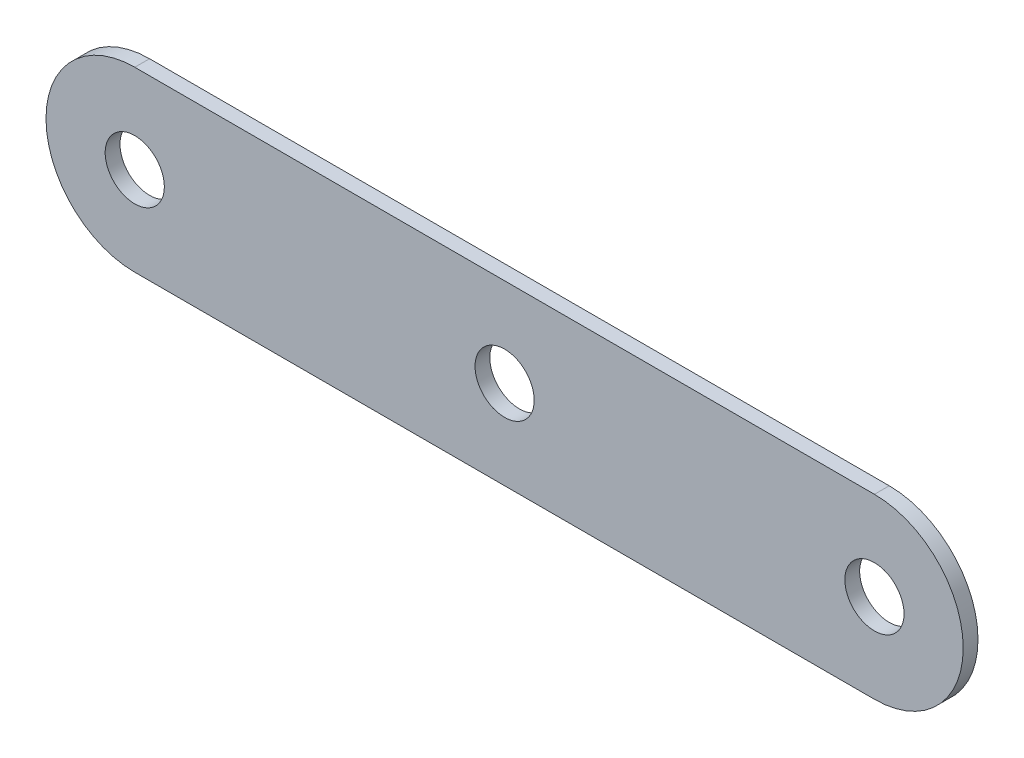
ISO-10303-21;
HEADER;
FILE_DESCRIPTION(('STEP AP214'),'2;1');
FILE_NAME('part.step','',(''),(''),'','','');
FILE_SCHEMA(('AUTOMOTIVE_DESIGN { 1 0 10303 214 1 1 1 1 }'));
ENDSEC;
DATA;
#1=APPLICATION_CONTEXT('core data for automotive mechanical design processes');
#2=APPLICATION_PROTOCOL_DEFINITION('international standard','automotive_design',2000,#1);
#3=PRODUCT_CONTEXT('',#1,'mechanical');
#4=PRODUCT('Part','Part','',(#3));
#5=PRODUCT_RELATED_PRODUCT_CATEGORY('part','',(#4));
#6=PRODUCT_DEFINITION_FORMATION('','',#4);
#7=PRODUCT_DEFINITION_CONTEXT('part definition',#1,'design');
#8=PRODUCT_DEFINITION('design','',#6,#7);
#9=PRODUCT_DEFINITION_SHAPE('','',#8);
#10=(LENGTH_UNIT() NAMED_UNIT(*) SI_UNIT(.MILLI.,.METRE.));
#11=(NAMED_UNIT(*) PLANE_ANGLE_UNIT() SI_UNIT($,.RADIAN.));
#12=(NAMED_UNIT(*) SI_UNIT($,.STERADIAN.) SOLID_ANGLE_UNIT());
#13=UNCERTAINTY_MEASURE_WITH_UNIT(LENGTH_MEASURE(1.E-05),#10,'distance_accuracy_value','');
#14=(GEOMETRIC_REPRESENTATION_CONTEXT(3) GLOBAL_UNCERTAINTY_ASSIGNED_CONTEXT((#13)) GLOBAL_UNIT_ASSIGNED_CONTEXT((#10,
#11,#12)) REPRESENTATION_CONTEXT('',''));
#15=CARTESIAN_POINT('',(0.,0.,0.));
#16=DIRECTION('',(0.,0.,1.));
#17=DIRECTION('',(1.,0.,0.));
#18=AXIS2_PLACEMENT_3D('',#15,#16,#17);
#19=CARTESIAN_POINT('',(-250.,-1.04083408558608E-13,5.));
#20=DIRECTION('',(0.,0.,1.));
#21=DIRECTION('',(1.,0.,0.));
#22=AXIS2_PLACEMENT_3D('',#19,#20,#21);
#23=PLANE('',#22);
#24=CARTESIAN_POINT('',(0.,0.,5.));
#25=DIRECTION('',(0.,0.,1.));
#26=DIRECTION('',(1.,0.,0.));
#27=AXIS2_PLACEMENT_3D('',#24,#25,#26);
#28=CIRCLE('',#27,20.);
#29=CARTESIAN_POINT('',(20.,0.,5.));
#30=VERTEX_POINT('',#29);
#31=EDGE_CURVE('E140',#30,#30,#28,.T.);
#32=ORIENTED_EDGE('',*,*,#31,.F.);
#33=EDGE_LOOP('',(#32));
#34=FACE_BOUND('',#33,.T.);
#35=CARTESIAN_POINT('',(-250.,-1.04083408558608E-13,5.));
#36=DIRECTION('',(0.,0.,1.));
#37=DIRECTION('',(1.,0.,0.));
#38=AXIS2_PLACEMENT_3D('',#35,#36,#37);
#39=CIRCLE('',#38,60.);
#40=CARTESIAN_POINT('',(-250.,60.,5.));
#41=VERTEX_POINT('',#40);
#42=CARTESIAN_POINT('',(-250.,-60.,5.));
#43=VERTEX_POINT('',#42);
#44=EDGE_CURVE('E98',#41,#43,#39,.T.);
#45=ORIENTED_EDGE('',*,*,#44,.T.);
#46=DIRECTION('',(1.,0.,0.));
#47=VECTOR('',#46,1.);
#48=CARTESIAN_POINT('',(250.,-60.,5.));
#49=LINE('',#48,#47);
#50=CARTESIAN_POINT('',(250.,-59.9999999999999,5.));
#51=VERTEX_POINT('',#50);
#52=EDGE_CURVE('E93',#43,#51,#49,.T.);
#53=ORIENTED_EDGE('',*,*,#52,.T.);
#54=CARTESIAN_POINT('',(250.,0.,5.));
#55=DIRECTION('',(0.,0.,1.));
#56=DIRECTION('',(-1.,0.,0.));
#57=AXIS2_PLACEMENT_3D('',#54,#55,#56);
#58=CIRCLE('',#57,60.);
#59=CARTESIAN_POINT('',(250.,60.,5.));
#60=VERTEX_POINT('',#59);
#61=EDGE_CURVE('E96',#51,#60,#58,.T.);
#62=ORIENTED_EDGE('',*,*,#61,.T.);
#63=DIRECTION('',(-1.,0.,0.));
#64=VECTOR('',#63,1.);
#65=CARTESIAN_POINT('',(250.,60.,5.));
#66=LINE('',#65,#64);
#67=EDGE_CURVE('E63',#60,#41,#66,.T.);
#68=ORIENTED_EDGE('',*,*,#67,.T.);
#69=EDGE_LOOP('',(#45,#53,#62,#68));
#70=FACE_BOUND('',#69,.T.);
#71=CARTESIAN_POINT('',(-250.,-1.04083408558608E-13,5.));
#72=DIRECTION('',(0.,0.,1.));
#73=DIRECTION('',(1.,0.,0.));
#74=AXIS2_PLACEMENT_3D('',#71,#72,#73);
#75=CIRCLE('',#74,20.);
#76=CARTESIAN_POINT('',(-230.,-1.04083408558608E-13,5.));
#77=VERTEX_POINT('',#76);
#78=EDGE_CURVE('E118',#77,#77,#75,.T.);
#79=ORIENTED_EDGE('',*,*,#78,.F.);
#80=EDGE_LOOP('',(#79));
#81=FACE_BOUND('',#80,.T.);
#82=CARTESIAN_POINT('',(250.,0.,5.));
#83=DIRECTION('',(0.,0.,1.));
#84=DIRECTION('',(1.,0.,0.));
#85=AXIS2_PLACEMENT_3D('',#82,#83,#84);
#86=CIRCLE('',#85,20.);
#87=CARTESIAN_POINT('',(270.,0.,5.));
#88=VERTEX_POINT('',#87);
#89=EDGE_CURVE('E148',#88,#88,#86,.T.);
#90=ORIENTED_EDGE('',*,*,#89,.F.);
#91=EDGE_LOOP('',(#90));
#92=FACE_BOUND('',#91,.T.);
#93=ADVANCED_FACE('F45',(#34,#70,#81,#92),#23,.T.);
#94=CARTESIAN_POINT('',(-250.,-1.04083408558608E-13,-5.));
#95=DIRECTION('',(0.,0.,1.));
#96=DIRECTION('',(1.,0.,0.));
#97=AXIS2_PLACEMENT_3D('',#94,#95,#96);
#98=PLANE('',#97);
#99=CARTESIAN_POINT('',(-250.,-1.04083408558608E-13,-5.));
#100=DIRECTION('',(0.,0.,1.));
#101=DIRECTION('',(1.,0.,0.));
#102=AXIS2_PLACEMENT_3D('',#99,#100,#101);
#103=CIRCLE('',#102,60.);
#104=CARTESIAN_POINT('',(-250.,60.,-5.));
#105=VERTEX_POINT('',#104);
#106=CARTESIAN_POINT('',(-250.,-60.,-5.));
#107=VERTEX_POINT('',#106);
#108=EDGE_CURVE('E114',#105,#107,#103,.T.);
#109=ORIENTED_EDGE('',*,*,#108,.F.);
#110=DIRECTION('',(-1.,0.,0.));
#111=VECTOR('',#110,1.);
#112=CARTESIAN_POINT('',(250.,60.,-5.));
#113=LINE('',#112,#111);
#114=CARTESIAN_POINT('',(250.,60.,-5.));
#115=VERTEX_POINT('',#114);
#116=EDGE_CURVE('E86',#115,#105,#113,.T.);
#117=ORIENTED_EDGE('',*,*,#116,.F.);
#118=CARTESIAN_POINT('',(250.,0.,-5.));
#119=DIRECTION('',(0.,0.,1.));
#120=DIRECTION('',(-1.,0.,0.));
#121=AXIS2_PLACEMENT_3D('',#118,#119,#120);
#122=CIRCLE('',#121,60.);
#123=CARTESIAN_POINT('',(250.,-59.9999999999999,-5.));
#124=VERTEX_POINT('',#123);
#125=EDGE_CURVE('E80',#124,#115,#122,.T.);
#126=ORIENTED_EDGE('',*,*,#125,.F.);
#127=DIRECTION('',(1.,0.,0.));
#128=VECTOR('',#127,1.);
#129=CARTESIAN_POINT('',(250.,-60.,-5.));
#130=LINE('',#129,#128);
#131=EDGE_CURVE('E103',#107,#124,#130,.T.);
#132=ORIENTED_EDGE('',*,*,#131,.F.);
#133=EDGE_LOOP('',(#109,#117,#126,#132));
#134=FACE_BOUND('',#133,.T.);
#135=CARTESIAN_POINT('',(-250.,-1.04083408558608E-13,-5.));
#136=DIRECTION('',(0.,0.,1.));
#137=DIRECTION('',(1.,0.,0.));
#138=AXIS2_PLACEMENT_3D('',#135,#136,#137);
#139=CIRCLE('',#138,20.);
#140=CARTESIAN_POINT('',(-230.,-1.04083408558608E-13,-5.));
#141=VERTEX_POINT('',#140);
#142=EDGE_CURVE('E136',#141,#141,#139,.T.);
#143=ORIENTED_EDGE('',*,*,#142,.T.);
#144=EDGE_LOOP('',(#143));
#145=FACE_BOUND('',#144,.T.);
#146=CARTESIAN_POINT('',(0.,0.,-5.));
#147=DIRECTION('',(0.,0.,1.));
#148=DIRECTION('',(1.,0.,0.));
#149=AXIS2_PLACEMENT_3D('',#146,#147,#148);
#150=CIRCLE('',#149,20.);
#151=CARTESIAN_POINT('',(20.,0.,-5.));
#152=VERTEX_POINT('',#151);
#153=EDGE_CURVE('E144',#152,#152,#150,.T.);
#154=ORIENTED_EDGE('',*,*,#153,.T.);
#155=EDGE_LOOP('',(#154));
#156=FACE_BOUND('',#155,.T.);
#157=CARTESIAN_POINT('',(250.,0.,-5.));
#158=DIRECTION('',(0.,0.,1.));
#159=DIRECTION('',(1.,0.,0.));
#160=AXIS2_PLACEMENT_3D('',#157,#158,#159);
#161=CIRCLE('',#160,20.);
#162=CARTESIAN_POINT('',(270.,0.,-5.));
#163=VERTEX_POINT('',#162);
#164=EDGE_CURVE('E152',#163,#163,#161,.T.);
#165=ORIENTED_EDGE('',*,*,#164,.T.);
#166=EDGE_LOOP('',(#165));
#167=FACE_BOUND('',#166,.T.);
#168=ADVANCED_FACE('F131',(#134,#145,#156,#167),#98,.F.);
#169=CARTESIAN_POINT('',(-250.,-1.04083408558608E-13,5.));
#170=DIRECTION('',(0.,0.,-1.));
#171=DIRECTION('',(-1.,0.,0.));
#172=AXIS2_PLACEMENT_3D('',#169,#170,#171);
#173=CYLINDRICAL_SURFACE('',#172,60.);
#174=ORIENTED_EDGE('',*,*,#108,.T.);
#175=DIRECTION('',(0.,0.,-1.));
#176=VECTOR('',#175,1.);
#177=CARTESIAN_POINT('',(-250.,-60.,5.));
#178=LINE('',#177,#176);
#179=EDGE_CURVE('E11',#43,#107,#178,.T.);
#180=ORIENTED_EDGE('',*,*,#179,.F.);
#181=ORIENTED_EDGE('',*,*,#44,.F.);
#182=DIRECTION('',(0.,0.,-1.));
#183=VECTOR('',#182,1.);
#184=CARTESIAN_POINT('',(-250.,60.,5.));
#185=LINE('',#184,#183);
#186=EDGE_CURVE('E110',#41,#105,#185,.T.);
#187=ORIENTED_EDGE('',*,*,#186,.T.);
#188=EDGE_LOOP('',(#174,#180,#181,#187));
#189=FACE_BOUND('',#188,.T.);
#190=ADVANCED_FACE('F47',(#189),#173,.T.);
#191=CARTESIAN_POINT('',(250.,-60.,5.));
#192=DIRECTION('',(0.,1.,0.));
#193=DIRECTION('',(0.,0.,1.));
#194=AXIS2_PLACEMENT_3D('',#191,#192,#193);
#195=PLANE('',#194);
#196=ORIENTED_EDGE('',*,*,#131,.T.);
#197=DIRECTION('',(0.,0.,-1.));
#198=VECTOR('',#197,1.);
#199=CARTESIAN_POINT('',(250.,-59.9999999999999,5.));
#200=LINE('',#199,#198);
#201=EDGE_CURVE('E55',#51,#124,#200,.T.);
#202=ORIENTED_EDGE('',*,*,#201,.F.);
#203=ORIENTED_EDGE('',*,*,#52,.F.);
#204=ORIENTED_EDGE('',*,*,#179,.T.);
#205=EDGE_LOOP('',(#196,#202,#203,#204));
#206=FACE_BOUND('',#205,.T.);
#207=ADVANCED_FACE('F102',(#206),#195,.F.);
#208=CARTESIAN_POINT('',(250.,0.,5.));
#209=DIRECTION('',(0.,0.,-1.));
#210=DIRECTION('',(-1.,0.,0.));
#211=AXIS2_PLACEMENT_3D('',#208,#209,#210);
#212=CYLINDRICAL_SURFACE('',#211,60.);
#213=ORIENTED_EDGE('',*,*,#125,.T.);
#214=DIRECTION('',(0.,0.,-1.));
#215=VECTOR('',#214,1.);
#216=CARTESIAN_POINT('',(250.,60.,5.));
#217=LINE('',#216,#215);
#218=EDGE_CURVE('E105',#60,#115,#217,.T.);
#219=ORIENTED_EDGE('',*,*,#218,.F.);
#220=ORIENTED_EDGE('',*,*,#61,.F.);
#221=ORIENTED_EDGE('',*,*,#201,.T.);
#222=EDGE_LOOP('',(#213,#219,#220,#221));
#223=FACE_BOUND('',#222,.T.);
#224=ADVANCED_FACE('F106',(#223),#212,.T.);
#225=CARTESIAN_POINT('',(250.,60.,5.));
#226=DIRECTION('',(0.,-1.,0.));
#227=DIRECTION('',(1.,0.,0.));
#228=AXIS2_PLACEMENT_3D('',#225,#226,#227);
#229=PLANE('',#228);
#230=ORIENTED_EDGE('',*,*,#116,.T.);
#231=ORIENTED_EDGE('',*,*,#186,.F.);
#232=ORIENTED_EDGE('',*,*,#67,.F.);
#233=ORIENTED_EDGE('',*,*,#218,.T.);
#234=EDGE_LOOP('',(#230,#231,#232,#233));
#235=FACE_BOUND('',#234,.T.);
#236=ADVANCED_FACE('F128',(#235),#229,.F.);
#237=CARTESIAN_POINT('',(-250.,-1.04083408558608E-13,5.));
#238=DIRECTION('',(0.,0.,-1.));
#239=DIRECTION('',(-1.,0.,0.));
#240=AXIS2_PLACEMENT_3D('',#237,#238,#239);
#241=CYLINDRICAL_SURFACE('',#240,20.);
#242=ORIENTED_EDGE('',*,*,#78,.T.);
#243=EDGE_LOOP('',(#242));
#244=FACE_BOUND('',#243,.T.);
#245=ORIENTED_EDGE('',*,*,#142,.F.);
#246=EDGE_LOOP('',(#245));
#247=FACE_BOUND('',#246,.T.);
#248=ADVANCED_FACE('F172',(#244,#247),#241,.F.);
#249=CARTESIAN_POINT('',(0.,0.,5.));
#250=DIRECTION('',(0.,0.,-1.));
#251=DIRECTION('',(-1.,0.,0.));
#252=AXIS2_PLACEMENT_3D('',#249,#250,#251);
#253=CYLINDRICAL_SURFACE('',#252,20.);
#254=ORIENTED_EDGE('',*,*,#31,.T.);
#255=EDGE_LOOP('',(#254));
#256=FACE_BOUND('',#255,.T.);
#257=ORIENTED_EDGE('',*,*,#153,.F.);
#258=EDGE_LOOP('',(#257));
#259=FACE_BOUND('',#258,.T.);
#260=ADVANCED_FACE('F217',(#256,#259),#253,.F.);
#261=CARTESIAN_POINT('',(250.,0.,5.));
#262=DIRECTION('',(0.,0.,-1.));
#263=DIRECTION('',(-1.,0.,0.));
#264=AXIS2_PLACEMENT_3D('',#261,#262,#263);
#265=CYLINDRICAL_SURFACE('',#264,20.);
#266=ORIENTED_EDGE('',*,*,#89,.T.);
#267=EDGE_LOOP('',(#266));
#268=FACE_BOUND('',#267,.T.);
#269=ORIENTED_EDGE('',*,*,#164,.F.);
#270=EDGE_LOOP('',(#269));
#271=FACE_BOUND('',#270,.T.);
#272=ADVANCED_FACE('F160',(#268,#271),#265,.F.);
#273=CLOSED_SHELL('',(#93,#168,#190,#207,#224,#236,#248,#260,#272));
#274=MANIFOLD_SOLID_BREP('B2',#273);
#275=ADVANCED_BREP_SHAPE_REPRESENTATION('',(#18,#274),#14);
#276=SHAPE_DEFINITION_REPRESENTATION(#9,#275);
ENDSEC;
END-ISO-10303-21;
